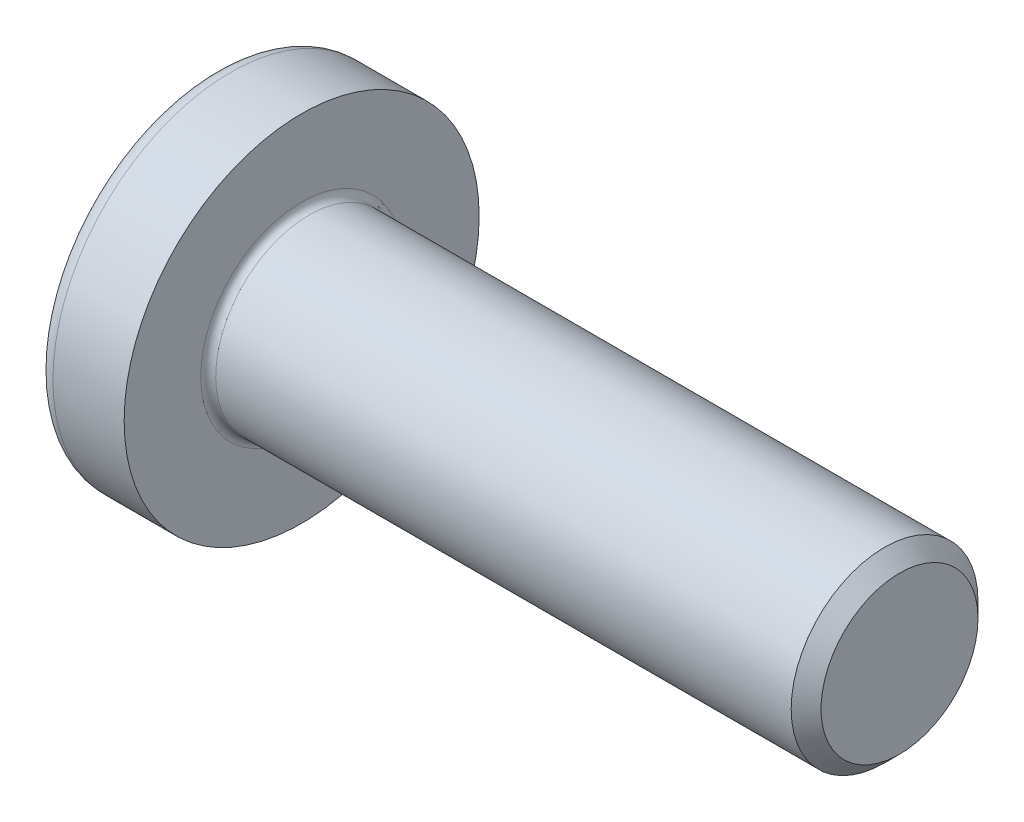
ISO-10303-21;
HEADER;
FILE_DESCRIPTION(('STEP AP214'),'2;1');
FILE_NAME('part.step','',(''),(''),'','','');
FILE_SCHEMA(('AUTOMOTIVE_DESIGN { 1 0 10303 214 1 1 1 1 }'));
ENDSEC;
DATA;
#1=APPLICATION_CONTEXT('core data for automotive mechanical design processes');
#2=APPLICATION_PROTOCOL_DEFINITION('international standard','automotive_design',2000,#1);
#3=PRODUCT_CONTEXT('',#1,'mechanical');
#4=PRODUCT('Part','Part','',(#3));
#5=PRODUCT_RELATED_PRODUCT_CATEGORY('part','',(#4));
#6=PRODUCT_DEFINITION_FORMATION('','',#4);
#7=PRODUCT_DEFINITION_CONTEXT('part definition',#1,'design');
#8=PRODUCT_DEFINITION('design','',#6,#7);
#9=PRODUCT_DEFINITION_SHAPE('','',#8);
#10=(LENGTH_UNIT() NAMED_UNIT(*) SI_UNIT(.MILLI.,.METRE.));
#11=(NAMED_UNIT(*) PLANE_ANGLE_UNIT() SI_UNIT($,.RADIAN.));
#12=(NAMED_UNIT(*) SI_UNIT($,.STERADIAN.) SOLID_ANGLE_UNIT());
#13=UNCERTAINTY_MEASURE_WITH_UNIT(LENGTH_MEASURE(1.E-05),#10,'distance_accuracy_value','');
#14=(GEOMETRIC_REPRESENTATION_CONTEXT(3) GLOBAL_UNCERTAINTY_ASSIGNED_CONTEXT((#13)) GLOBAL_UNIT_ASSIGNED_CONTEXT((#10,
#11,#12)) REPRESENTATION_CONTEXT('',''));
#15=CARTESIAN_POINT('',(0.,0.,0.));
#16=DIRECTION('',(0.,0.,1.));
#17=DIRECTION('',(1.,0.,0.));
#18=AXIS2_PLACEMENT_3D('',#15,#16,#17);
#19=CARTESIAN_POINT('',(8.,0.,0.));
#20=DIRECTION('',(-1.,0.,0.));
#21=DIRECTION('',(0.,1.,0.));
#22=AXIS2_PLACEMENT_3D('',#19,#20,#21);
#23=SPHERICAL_SURFACE('',#22,8.);
#24=CARTESIAN_POINT('',(1.42427123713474,0.,0.));
#25=DIRECTION('',(-1.,0.,0.));
#26=DIRECTION('',(0.,0.,1.));
#27=AXIS2_PLACEMENT_3D('',#24,#25,#26);
#28=CIRCLE('',#27,4.55629139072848);
#29=CARTESIAN_POINT('',(1.42427123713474,0.,4.55629139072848));
#30=VERTEX_POINT('',#29);
#31=EDGE_CURVE('E371',#30,#30,#28,.T.);
#32=ORIENTED_EDGE('',*,*,#31,.T.);
#33=EDGE_LOOP('',(#32));
#34=FACE_BOUND('',#33,.T.);
#35=CARTESIAN_POINT('',(0.0676093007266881,0.,0.));
#36=DIRECTION('',(1.,0.,0.));
#37=DIRECTION('',(0.,0.,-1.));
#38=AXIS2_PLACEMENT_3D('',#35,#36,#37);
#39=CIRCLE('',#38,1.03787176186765);
#40=CARTESIAN_POINT('',(0.067609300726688,-0.514999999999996,-0.901084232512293));
#41=VERTEX_POINT('',#40);
#42=CARTESIAN_POINT('',(0.0676093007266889,-0.901084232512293,-0.515));
#43=VERTEX_POINT('',#42);
#44=EDGE_CURVE('E414',#41,#43,#39,.F.);
#45=ORIENTED_EDGE('',*,*,#44,.F.);
#46=CARTESIAN_POINT('',(8.,-0.515,0.));
#47=DIRECTION('',(0.,1.,0.));
#48=DIRECTION('',(0.,0.,1.));
#49=AXIS2_PLACEMENT_3D('',#46,#47,#48);
#50=CIRCLE('',#49,7.98340622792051);
#51=CARTESIAN_POINT('',(0.322606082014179,-0.514999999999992,-2.18915454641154));
#52=VERTEX_POINT('',#51);
#53=EDGE_CURVE('E363',#52,#41,#50,.T.);
#54=ORIENTED_EDGE('',*,*,#53,.F.);
#55=CARTESIAN_POINT('',(7.34565688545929,0.,1.31240929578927));
#56=DIRECTION('',(0.446197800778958,0.,-0.89493436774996));
#57=DIRECTION('',(-0.89493436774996,0.,-0.446197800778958));
#58=AXIS2_PLACEMENT_3D('',#55,#56,#57);
#59=CIRCLE('',#58,7.86444002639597);
#60=CARTESIAN_POINT('',(0.322606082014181,0.515000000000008,-2.18915454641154));
#61=VERTEX_POINT('',#60);
#62=EDGE_CURVE('E237',#52,#61,#59,.T.);
#63=ORIENTED_EDGE('',*,*,#62,.T.);
#64=CARTESIAN_POINT('',(8.,0.515,0.));
#65=DIRECTION('',(0.,-1.,0.));
#66=DIRECTION('',(0.,0.,-1.));
#67=AXIS2_PLACEMENT_3D('',#64,#65,#66);
#68=CIRCLE('',#67,7.98340622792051);
#69=CARTESIAN_POINT('',(0.0676093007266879,0.515000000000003,-0.901084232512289));
#70=VERTEX_POINT('',#69);
#71=EDGE_CURVE('E367',#70,#61,#68,.T.);
#72=ORIENTED_EDGE('',*,*,#71,.F.);
#73=CARTESIAN_POINT('',(0.0676093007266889,0.901084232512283,-0.515));
#74=VERTEX_POINT('',#73);
#75=EDGE_CURVE('E438',#74,#70,#39,.F.);
#76=ORIENTED_EDGE('',*,*,#75,.F.);
#77=CARTESIAN_POINT('',(8.,0.,-0.515));
#78=DIRECTION('',(0.,0.,1.));
#79=DIRECTION('',(1.,0.,0.));
#80=AXIS2_PLACEMENT_3D('',#77,#78,#79);
#81=CIRCLE('',#80,7.98340622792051);
#82=CARTESIAN_POINT('',(0.32260608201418,2.18915454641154,-0.515));
#83=VERTEX_POINT('',#82);
#84=EDGE_CURVE('E231',#83,#74,#81,.T.);
#85=ORIENTED_EDGE('',*,*,#84,.F.);
#86=CARTESIAN_POINT('',(7.34565688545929,-1.31240929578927,0.));
#87=DIRECTION('',(0.446197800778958,0.89493436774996,0.));
#88=DIRECTION('',(-0.89493436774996,0.446197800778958,0.));
#89=AXIS2_PLACEMENT_3D('',#86,#87,#88);
#90=CIRCLE('',#89,7.86444002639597);
#91=CARTESIAN_POINT('',(0.322606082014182,2.18915454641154,0.514999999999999));
#92=VERTEX_POINT('',#91);
#93=EDGE_CURVE('E234',#83,#92,#90,.T.);
#94=ORIENTED_EDGE('',*,*,#93,.T.);
#95=CARTESIAN_POINT('',(8.,0.,0.515));
#96=DIRECTION('',(0.,0.,-1.));
#97=DIRECTION('',(0.,1.,0.));
#98=AXIS2_PLACEMENT_3D('',#95,#96,#97);
#99=CIRCLE('',#98,7.98340622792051);
#100=CARTESIAN_POINT('',(0.0676093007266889,0.901084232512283,0.515));
#101=VERTEX_POINT('',#100);
#102=EDGE_CURVE('E227',#101,#92,#99,.T.);
#103=ORIENTED_EDGE('',*,*,#102,.F.);
#104=CARTESIAN_POINT('',(0.067609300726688,0.514999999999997,0.901084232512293));
#105=VERTEX_POINT('',#104);
#106=EDGE_CURVE('E435',#105,#101,#39,.F.);
#107=ORIENTED_EDGE('',*,*,#106,.F.);
#108=CARTESIAN_POINT('',(0.322606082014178,0.514999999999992,2.18915454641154));
#109=VERTEX_POINT('',#108);
#110=EDGE_CURVE('E364',#109,#105,#68,.T.);
#111=ORIENTED_EDGE('',*,*,#110,.F.);
#112=CARTESIAN_POINT('',(7.34565688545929,0.,-1.31240929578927));
#113=DIRECTION('',(0.446197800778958,0.,0.89493436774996));
#114=DIRECTION('',(0.89493436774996,0.,-0.446197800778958));
#115=AXIS2_PLACEMENT_3D('',#112,#113,#114);
#116=CIRCLE('',#115,7.86444002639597);
#117=CARTESIAN_POINT('',(0.32260608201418,-0.515000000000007,2.18915454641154));
#118=VERTEX_POINT('',#117);
#119=EDGE_CURVE('E240',#109,#118,#116,.T.);
#120=ORIENTED_EDGE('',*,*,#119,.T.);
#121=CARTESIAN_POINT('',(0.0676093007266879,-0.515000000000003,0.901084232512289));
#122=VERTEX_POINT('',#121);
#123=EDGE_CURVE('E361',#122,#118,#50,.T.);
#124=ORIENTED_EDGE('',*,*,#123,.F.);
#125=CARTESIAN_POINT('',(0.0676093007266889,-0.901084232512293,0.514999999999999));
#126=VERTEX_POINT('',#125);
#127=EDGE_CURVE('E297',#126,#122,#39,.F.);
#128=ORIENTED_EDGE('',*,*,#127,.F.);
#129=CARTESIAN_POINT('',(0.322606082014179,-2.18915454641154,0.514999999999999));
#130=VERTEX_POINT('',#129);
#131=EDGE_CURVE('E228',#130,#126,#99,.T.);
#132=ORIENTED_EDGE('',*,*,#131,.F.);
#133=CARTESIAN_POINT('',(7.34565688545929,1.31240929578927,0.));
#134=DIRECTION('',(0.446197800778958,-0.89493436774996,0.));
#135=DIRECTION('',(0.89493436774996,0.446197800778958,0.));
#136=AXIS2_PLACEMENT_3D('',#133,#134,#135);
#137=CIRCLE('',#136,7.86444002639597);
#138=CARTESIAN_POINT('',(0.322606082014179,-2.18915454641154,-0.515));
#139=VERTEX_POINT('',#138);
#140=EDGE_CURVE('E218',#130,#139,#137,.T.);
#141=ORIENTED_EDGE('',*,*,#140,.T.);
#142=EDGE_CURVE('E57',#43,#139,#81,.T.);
#143=ORIENTED_EDGE('',*,*,#142,.F.);
#144=EDGE_LOOP('',(#45,#54,#63,#72,#76,#85,#94,#103,#107,#111,#120,#124,#128,#132,#141,#143));
#145=FACE_BOUND('',#144,.T.);
#146=ADVANCED_FACE('F34',(#34,#145),#23,.T.);
#147=CARTESIAN_POINT('',(0.,2.35,-0.515));
#148=DIRECTION('',(0.,0.,1.));
#149=DIRECTION('',(1.,0.,0.));
#150=AXIS2_PLACEMENT_3D('',#147,#148,#149);
#151=PLANE('',#150);
#152=ORIENTED_EDGE('',*,*,#84,.T.);
#153=CARTESIAN_POINT('',(-1.51390484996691,1.02651837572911,-0.515));
#154=CARTESIAN_POINT('',(-1.19828075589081,1.00181934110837,-0.515));
#155=CARTESIAN_POINT('',(-0.882669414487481,0.976954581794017,-0.515));
#156=CARTESIAN_POINT('',(-0.251463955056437,0.926774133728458,-0.515));
#157=CARTESIAN_POINT('',(0.0641301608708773,0.901458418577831,-0.515));
#158=CARTESIAN_POINT('',(0.537487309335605,0.863059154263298,-0.515));
#159=CARTESIAN_POINT('',(0.695267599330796,0.850188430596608,-0.515));
#160=CARTESIAN_POINT('',(1.01081295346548,0.824283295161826,-0.515));
#161=CARTESIAN_POINT('',(1.16857801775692,0.811248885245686,-0.515));
#162=CARTESIAN_POINT('',(1.48408237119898,0.784992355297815,-0.515));
#163=CARTESIAN_POINT('',(1.64182166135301,0.771770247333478,-0.515));
#164=CARTESIAN_POINT('',(1.95728793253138,0.7451057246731,-0.515));
#165=CARTESIAN_POINT('',(2.11501491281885,0.731663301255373,-0.515));
#166=CARTESIAN_POINT('',(2.48551875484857,0.699781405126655,-0.515));
#167=CARTESIAN_POINT('',(2.69828652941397,0.681236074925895,-0.515));
#168=CARTESIAN_POINT('',(3.12376344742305,0.643549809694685,-0.515));
#169=CARTESIAN_POINT('',(3.33647259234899,0.624408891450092,-0.515));
#170=CARTESIAN_POINT('',(3.76177021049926,0.585350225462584,-0.515));
#171=CARTESIAN_POINT('',(3.97435870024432,0.565432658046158,-0.515));
#172=CARTESIAN_POINT('',(4.39945864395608,0.524537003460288,-0.515));
#173=CARTESIAN_POINT('',(4.61197008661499,0.503558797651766,-0.515));
#174=CARTESIAN_POINT('',(4.93071637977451,0.470931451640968,-0.515));
#175=CARTESIAN_POINT('',(5.03701000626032,0.459857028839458,-0.515));
#176=CARTESIAN_POINT('',(5.24954252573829,0.437229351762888,-0.515));
#177=CARTESIAN_POINT('',(5.35578142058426,0.425676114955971,-0.515));
#178=CARTESIAN_POINT('',(5.56815317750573,0.401967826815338,-0.515));
#179=CARTESIAN_POINT('',(5.6742860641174,0.389812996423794,-0.515));
#180=CARTESIAN_POINT('',(5.88647145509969,0.364705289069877,-0.515));
#181=CARTESIAN_POINT('',(5.99252394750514,0.35175231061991,-0.515));
#182=CARTESIAN_POINT('',(6.20462993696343,0.324739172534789,-0.515));
#183=CARTESIAN_POINT('',(6.31068325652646,0.310677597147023,-0.515));
#184=CARTESIAN_POINT('',(6.46957142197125,0.288366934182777,-0.515));
#185=CARTESIAN_POINT('',(6.52249184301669,0.280728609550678,-0.515));
#186=CARTESIAN_POINT('',(6.62826069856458,0.2649303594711,-0.515));
#187=CARTESIAN_POINT('',(6.68110912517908,0.256770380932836,-0.515));
#188=CARTESIAN_POINT('',(6.78677752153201,0.239755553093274,-0.515));
#189=CARTESIAN_POINT('',(6.83959732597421,0.230899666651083,-0.515));
#190=CARTESIAN_POINT('',(6.94505554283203,0.212240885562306,-0.515));
#191=CARTESIAN_POINT('',(6.99769400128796,0.202438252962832,-0.515));
#192=CARTESIAN_POINT('',(7.10276751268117,0.181407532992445,-0.515));
#193=CARTESIAN_POINT('',(7.1552022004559,0.17017756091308,-0.515));
#194=CARTESIAN_POINT('',(7.23345080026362,0.151498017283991,-0.515));
#195=CARTESIAN_POINT('',(7.25947836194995,0.144962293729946,-0.515));
#196=CARTESIAN_POINT('',(7.31128722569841,0.130937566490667,-0.515));
#197=CARTESIAN_POINT('',(7.33706839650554,0.123448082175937,-0.515));
#198=CARTESIAN_POINT('',(7.36266137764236,0.115313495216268,-0.515));
#199=B_SPLINE_CURVE_WITH_KNOTS('',3,(#153,#154,#155,#156,#157,#158,#159,#160,#161,#162,#163,
#164,#165,#166,#167,#168,#169,#170,#171,#172,#173,#174,#175,#176,#177,#178,#179,#180,#181,#182,
#183,#184,#185,#186,#187,#188,#189,#190,#191,#192,#193,#194,#195,#196,#197,#198),.UNSPECIFIED.,
.F.,.F.,(4,2,2,2,2,2,2,2,2,2,2,2,2,2,2,2,2,2,2,2,2,2,4),(0.,0.949767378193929,1.89959054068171,
2.37450359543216,2.84941128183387,3.32428857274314,3.79918470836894,4.43990748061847,
5.08061221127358,5.72116905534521,6.36179770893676,6.68240380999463,7.0029982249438,
7.32347575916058,7.64399412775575,7.96492866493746,8.12533319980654,8.28575408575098,
8.44641876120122,8.60703909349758,8.76787376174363,8.84836551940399,8.92889800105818),.UNSPECIFIED.);
#200=CARTESIAN_POINT('',(2.74,0.677477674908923,-0.515));
#201=VERTEX_POINT('',#200);
#202=EDGE_CURVE('E275',#74,#201,#199,.T.);
#203=ORIENTED_EDGE('',*,*,#202,.T.);
#204=DIRECTION('',(0.,1.,0.));
#205=VECTOR('',#204,1.);
#206=CARTESIAN_POINT('',(2.74,-0.983886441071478,-0.515));
#207=LINE('',#206,#205);
#208=CARTESIAN_POINT('',(2.74,0.983886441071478,-0.515));
#209=VERTEX_POINT('',#208);
#210=EDGE_CURVE('E392',#201,#209,#207,.T.);
#211=ORIENTED_EDGE('',*,*,#210,.T.);
#212=DIRECTION('',(0.89493436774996,-0.446197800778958,0.));
#213=VECTOR('',#212,1.);
#214=CARTESIAN_POINT('',(0.,2.35,-0.515));
#215=LINE('',#214,#213);
#216=EDGE_CURVE('E368',#83,#209,#215,.T.);
#217=ORIENTED_EDGE('',*,*,#216,.F.);
#218=EDGE_LOOP('',(#152,#203,#211,#217));
#219=FACE_BOUND('',#218,.T.);
#220=ADVANCED_FACE('F166',(#219),#151,.T.);
#221=CARTESIAN_POINT('',(2.74,-0.983886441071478,-0.515));
#222=VERTEX_POINT('',#221);
#223=CARTESIAN_POINT('',(2.74,-0.677477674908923,-0.515));
#224=VERTEX_POINT('',#223);
#225=EDGE_CURVE('E389',#222,#224,#207,.T.);
#226=ORIENTED_EDGE('',*,*,#225,.T.);
#227=CARTESIAN_POINT('',(-1.51390484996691,-1.02651837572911,-0.515));
#228=CARTESIAN_POINT('',(-1.19828075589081,-1.00181934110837,-0.515));
#229=CARTESIAN_POINT('',(-0.882669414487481,-0.976954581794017,-0.515));
#230=CARTESIAN_POINT('',(-0.251463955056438,-0.926774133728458,-0.515));
#231=CARTESIAN_POINT('',(0.0641301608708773,-0.901458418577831,-0.515));
#232=CARTESIAN_POINT('',(0.537487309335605,-0.863059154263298,-0.515));
#233=CARTESIAN_POINT('',(0.695267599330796,-0.850188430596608,-0.515));
#234=CARTESIAN_POINT('',(1.01081295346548,-0.824283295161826,-0.515));
#235=CARTESIAN_POINT('',(1.16857801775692,-0.811248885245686,-0.515));
#236=CARTESIAN_POINT('',(1.48408237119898,-0.784992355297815,-0.515));
#237=CARTESIAN_POINT('',(1.64182166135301,-0.771770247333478,-0.515));
#238=CARTESIAN_POINT('',(1.95728793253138,-0.7451057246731,-0.515));
#239=CARTESIAN_POINT('',(2.11501491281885,-0.731663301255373,-0.515));
#240=CARTESIAN_POINT('',(2.48551875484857,-0.699781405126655,-0.515));
#241=CARTESIAN_POINT('',(2.69828652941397,-0.681236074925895,-0.515));
#242=CARTESIAN_POINT('',(3.12376344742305,-0.643549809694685,-0.515));
#243=CARTESIAN_POINT('',(3.33647259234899,-0.624408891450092,-0.515));
#244=CARTESIAN_POINT('',(3.76177021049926,-0.585350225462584,-0.515));
#245=CARTESIAN_POINT('',(3.97435870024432,-0.565432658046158,-0.515));
#246=CARTESIAN_POINT('',(4.39945864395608,-0.524537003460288,-0.515));
#247=CARTESIAN_POINT('',(4.61197008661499,-0.503558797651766,-0.515));
#248=CARTESIAN_POINT('',(4.93071637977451,-0.470931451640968,-0.515));
#249=CARTESIAN_POINT('',(5.03701000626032,-0.459857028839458,-0.515));
#250=CARTESIAN_POINT('',(5.24954252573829,-0.437229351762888,-0.515));
#251=CARTESIAN_POINT('',(5.35578142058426,-0.425676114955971,-0.515));
#252=CARTESIAN_POINT('',(5.56815317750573,-0.401967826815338,-0.515));
#253=CARTESIAN_POINT('',(5.6742860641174,-0.389812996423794,-0.515));
#254=CARTESIAN_POINT('',(5.88647145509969,-0.364705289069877,-0.515));
#255=CARTESIAN_POINT('',(5.99252394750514,-0.35175231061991,-0.515));
#256=CARTESIAN_POINT('',(6.20462993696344,-0.324739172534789,-0.515));
#257=CARTESIAN_POINT('',(6.31068325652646,-0.310677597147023,-0.515));
#258=CARTESIAN_POINT('',(6.46957142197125,-0.288366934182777,-0.515));
#259=CARTESIAN_POINT('',(6.52249184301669,-0.280728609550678,-0.515));
#260=CARTESIAN_POINT('',(6.62826069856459,-0.2649303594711,-0.515));
#261=CARTESIAN_POINT('',(6.68110912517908,-0.256770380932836,-0.515));
#262=CARTESIAN_POINT('',(6.78677752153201,-0.239755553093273,-0.515));
#263=CARTESIAN_POINT('',(6.83959732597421,-0.230899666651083,-0.515));
#264=CARTESIAN_POINT('',(6.94505554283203,-0.212240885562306,-0.515));
#265=CARTESIAN_POINT('',(6.99769400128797,-0.202438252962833,-0.515));
#266=CARTESIAN_POINT('',(7.10276751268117,-0.181407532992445,-0.515));
#267=CARTESIAN_POINT('',(7.1552022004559,-0.170177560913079,-0.515));
#268=CARTESIAN_POINT('',(7.23345080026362,-0.15149801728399,-0.515));
#269=CARTESIAN_POINT('',(7.25947836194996,-0.144962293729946,-0.515));
#270=CARTESIAN_POINT('',(7.31128722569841,-0.130937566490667,-0.515));
#271=CARTESIAN_POINT('',(7.33706839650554,-0.123448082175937,-0.515));
#272=CARTESIAN_POINT('',(7.36266137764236,-0.115313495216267,-0.515));
#273=B_SPLINE_CURVE_WITH_KNOTS('',3,(#227,#228,#229,#230,#231,#232,#233,#234,#235,#236,#237,
#238,#239,#240,#241,#242,#243,#244,#245,#246,#247,#248,#249,#250,#251,#252,#253,#254,#255,#256,
#257,#258,#259,#260,#261,#262,#263,#264,#265,#266,#267,#268,#269,#270,#271,#272),.UNSPECIFIED.,
.F.,.F.,(4,2,2,2,2,2,2,2,2,2,2,2,2,2,2,2,2,2,2,2,2,2,4),(0.,0.949767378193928,1.89959054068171,
2.37450359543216,2.84941128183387,3.32428857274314,3.79918470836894,4.43990748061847,
5.08061221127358,5.72116905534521,6.36179770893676,6.68240380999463,7.0029982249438,
7.32347575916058,7.64399412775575,7.96492866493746,8.12533319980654,8.28575408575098,
8.44641876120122,8.60703909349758,8.76787376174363,8.84836551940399,8.92889800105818),.UNSPECIFIED.);
#274=EDGE_CURVE('E262',#224,#43,#273,.F.);
#275=ORIENTED_EDGE('',*,*,#274,.T.);
#276=ORIENTED_EDGE('',*,*,#142,.T.);
#277=DIRECTION('',(0.89493436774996,0.446197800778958,0.));
#278=VECTOR('',#277,1.);
#279=CARTESIAN_POINT('',(0.,-2.35,-0.515));
#280=LINE('',#279,#278);
#281=EDGE_CURVE('E374',#139,#222,#280,.T.);
#282=ORIENTED_EDGE('',*,*,#281,.T.);
#283=EDGE_LOOP('',(#226,#275,#276,#282));
#284=FACE_BOUND('',#283,.T.);
#285=ADVANCED_FACE('F172',(#284),#151,.T.);
#286=CARTESIAN_POINT('',(0.,-2.35,0.514999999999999));
#287=DIRECTION('',(0.,0.,-1.));
#288=DIRECTION('',(0.,1.,0.));
#289=AXIS2_PLACEMENT_3D('',#286,#287,#288);
#290=PLANE('',#289);
#291=DIRECTION('',(0.,-1.,0.));
#292=VECTOR('',#291,1.);
#293=CARTESIAN_POINT('',(2.74,0.983886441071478,0.515));
#294=LINE('',#293,#292);
#295=CARTESIAN_POINT('',(2.74,0.983886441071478,0.515));
#296=VERTEX_POINT('',#295);
#297=CARTESIAN_POINT('',(2.74,0.677477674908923,0.515));
#298=VERTEX_POINT('',#297);
#299=EDGE_CURVE('E382',#296,#298,#294,.T.);
#300=ORIENTED_EDGE('',*,*,#299,.T.);
#301=CARTESIAN_POINT('',(-1.51390485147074,1.02651837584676,0.514999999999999));
#302=CARTESIAN_POINT('',(-1.19828075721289,1.00181934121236,0.514999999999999));
#303=CARTESIAN_POINT('',(-0.882669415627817,0.976954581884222,0.514999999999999));
#304=CARTESIAN_POINT('',(-0.251463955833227,0.926774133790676,0.515));
#305=CARTESIAN_POINT('',(0.0641301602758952,0.901458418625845,0.515));
#306=CARTESIAN_POINT('',(0.537487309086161,0.863059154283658,0.515));
#307=CARTESIAN_POINT('',(0.695267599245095,0.85018843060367,0.515));
#308=CARTESIAN_POINT('',(1.01081295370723,0.824283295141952,0.515));
#309=CARTESIAN_POINT('',(1.16857801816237,0.811248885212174,0.515));
#310=CARTESIAN_POINT('',(1.48408237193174,0.784992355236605,0.515));
#311=CARTESIAN_POINT('',(1.64182166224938,0.771770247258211,0.515));
#312=CARTESIAN_POINT('',(1.95728793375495,0.745105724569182,0.515));
#313=CARTESIAN_POINT('',(2.11501491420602,0.731663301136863,0.515));
#314=CARTESIAN_POINT('',(2.48551875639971,0.699781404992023,0.515));
#315=CARTESIAN_POINT('',(2.6982865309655,0.681236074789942,0.515));
#316=CARTESIAN_POINT('',(3.12376344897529,0.643549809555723,0.515));
#317=CARTESIAN_POINT('',(3.33647259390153,0.624408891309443,0.515));
#318=CARTESIAN_POINT('',(3.76177021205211,0.585350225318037,0.515));
#319=CARTESIAN_POINT('',(3.97435870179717,0.565432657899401,0.515));
#320=CARTESIAN_POINT('',(4.39945864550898,0.524537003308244,0.515));
#321=CARTESIAN_POINT('',(4.61197008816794,0.503558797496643,0.515));
#322=CARTESIAN_POINT('',(4.9307163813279,0.470931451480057,0.515));
#323=CARTESIAN_POINT('',(5.03701000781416,0.459857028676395,0.515));
#324=CARTESIAN_POINT('',(5.24954252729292,0.437229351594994,0.515));
#325=CARTESIAN_POINT('',(5.35578142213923,0.4256761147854,0.515));
#326=CARTESIAN_POINT('',(5.56815317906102,0.401967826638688,0.515));
#327=CARTESIAN_POINT('',(5.67428606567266,0.389812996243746,0.515));
#328=CARTESIAN_POINT('',(5.88647145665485,0.36470528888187,0.515));
#329=CARTESIAN_POINT('',(5.99252394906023,0.351752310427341,0.515));
#330=CARTESIAN_POINT('',(6.204629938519,0.324739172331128,0.515));
#331=CARTESIAN_POINT('',(6.31068325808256,0.31067759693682,0.515));
#332=CARTESIAN_POINT('',(6.46957142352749,0.288366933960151,0.515));
#333=CARTESIAN_POINT('',(6.52249184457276,0.280728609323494,0.515));
#334=CARTESIAN_POINT('',(6.62826070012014,0.26493035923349,0.515));
#335=CARTESIAN_POINT('',(6.68110912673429,0.256770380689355,0.515));
#336=CARTESIAN_POINT('',(6.7867775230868,0.239755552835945,0.515));
#337=CARTESIAN_POINT('',(6.83959732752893,0.230899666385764,0.515));
#338=CARTESIAN_POINT('',(6.94505554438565,0.212240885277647,0.515));
#339=CARTESIAN_POINT('',(6.99769400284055,0.202438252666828,0.515));
#340=CARTESIAN_POINT('',(7.10276751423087,0.181407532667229,0.515));
#341=CARTESIAN_POINT('',(7.15520220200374,0.170177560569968,0.515));
#342=CARTESIAN_POINT('',(7.23345080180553,0.151498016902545,0.515));
#343=CARTESIAN_POINT('',(7.25947836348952,0.144962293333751,0.515));
#344=CARTESIAN_POINT('',(7.31128722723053,0.130937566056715,0.515));
#345=CARTESIAN_POINT('',(7.33706839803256,0.123448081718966,0.515));
#346=CARTESIAN_POINT('',(7.36266137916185,0.115313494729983,0.515));
#347=B_SPLINE_CURVE_WITH_KNOTS('',3,(#301,#302,#303,#304,#305,#306,#307,#308,#309,#310,#311,
#312,#313,#314,#315,#316,#317,#318,#319,#320,#321,#322,#323,#324,#325,#326,#327,#328,#329,#330,
#331,#332,#333,#334,#335,#336,#337,#338,#339,#340,#341,#342,#343,#344,#345,#346),.UNSPECIFIED.,
.F.,.F.,(4,2,2,2,2,2,2,2,2,2,2,2,2,2,2,2,2,2,2,2,2,2,4),(0.,0.949767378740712,1.89959054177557,
2.37450359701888,2.8494112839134,3.32428857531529,3.79918471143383,4.43990748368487,
5.08061221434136,5.7211690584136,6.36179771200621,6.68240381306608,7.00299822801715,
7.32347576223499,7.6439941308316,7.96492866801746,8.12533320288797,8.28575408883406,
8.44641876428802,8.6070390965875,8.76787376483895,8.84836552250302,8.92889800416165),.UNSPECIFIED.);
#348=EDGE_CURVE('E286',#298,#101,#347,.F.);
#349=ORIENTED_EDGE('',*,*,#348,.T.);
#350=ORIENTED_EDGE('',*,*,#102,.T.);
#351=DIRECTION('',(0.89493436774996,-0.446197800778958,0.));
#352=VECTOR('',#351,1.);
#353=CARTESIAN_POINT('',(0.,2.35,0.515));
#354=LINE('',#353,#352);
#355=EDGE_CURVE('E372',#92,#296,#354,.T.);
#356=ORIENTED_EDGE('',*,*,#355,.T.);
#357=EDGE_LOOP('',(#300,#349,#350,#356));
#358=FACE_BOUND('',#357,.T.);
#359=ADVANCED_FACE('F307',(#358),#290,.T.);
#360=ORIENTED_EDGE('',*,*,#131,.T.);
#361=CARTESIAN_POINT('',(-1.51390485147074,-1.02651837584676,0.514999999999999));
#362=CARTESIAN_POINT('',(-1.19828075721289,-1.00181934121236,0.514999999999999));
#363=CARTESIAN_POINT('',(-0.882669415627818,-0.976954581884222,0.514999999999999));
#364=CARTESIAN_POINT('',(-0.251463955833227,-0.926774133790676,0.514999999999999));
#365=CARTESIAN_POINT('',(0.0641301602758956,-0.901458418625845,0.514999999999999));
#366=CARTESIAN_POINT('',(0.537487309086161,-0.863059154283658,0.514999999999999));
#367=CARTESIAN_POINT('',(0.695267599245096,-0.850188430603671,0.514999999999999));
#368=CARTESIAN_POINT('',(1.01081295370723,-0.824283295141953,0.514999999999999));
#369=CARTESIAN_POINT('',(1.16857801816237,-0.811248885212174,0.514999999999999));
#370=CARTESIAN_POINT('',(1.48408237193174,-0.784992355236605,0.514999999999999));
#371=CARTESIAN_POINT('',(1.64182166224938,-0.771770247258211,0.514999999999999));
#372=CARTESIAN_POINT('',(1.95728793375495,-0.745105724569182,0.514999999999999));
#373=CARTESIAN_POINT('',(2.11501491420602,-0.731663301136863,0.515));
#374=CARTESIAN_POINT('',(2.48551875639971,-0.699781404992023,0.515));
#375=CARTESIAN_POINT('',(2.6982865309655,-0.681236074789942,0.515));
#376=CARTESIAN_POINT('',(3.12376344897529,-0.643549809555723,0.515));
#377=CARTESIAN_POINT('',(3.33647259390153,-0.624408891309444,0.515));
#378=CARTESIAN_POINT('',(3.76177021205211,-0.585350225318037,0.515));
#379=CARTESIAN_POINT('',(3.97435870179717,-0.565432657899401,0.515));
#380=CARTESIAN_POINT('',(4.39945864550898,-0.524537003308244,0.515));
#381=CARTESIAN_POINT('',(4.61197008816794,-0.503558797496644,0.515));
#382=CARTESIAN_POINT('',(4.9307163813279,-0.470931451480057,0.515));
#383=CARTESIAN_POINT('',(5.03701000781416,-0.459857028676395,0.515));
#384=CARTESIAN_POINT('',(5.24954252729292,-0.437229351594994,0.515));
#385=CARTESIAN_POINT('',(5.35578142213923,-0.4256761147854,0.515));
#386=CARTESIAN_POINT('',(5.56815317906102,-0.401967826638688,0.515));
#387=CARTESIAN_POINT('',(5.67428606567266,-0.389812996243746,0.515));
#388=CARTESIAN_POINT('',(5.88647145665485,-0.36470528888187,0.515));
#389=CARTESIAN_POINT('',(5.99252394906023,-0.351752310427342,0.515));
#390=CARTESIAN_POINT('',(6.20462993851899,-0.324739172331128,0.515));
#391=CARTESIAN_POINT('',(6.31068325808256,-0.31067759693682,0.515));
#392=CARTESIAN_POINT('',(6.46957142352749,-0.288366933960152,0.515));
#393=CARTESIAN_POINT('',(6.52249184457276,-0.280728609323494,0.515));
#394=CARTESIAN_POINT('',(6.62826070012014,-0.264930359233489,0.515));
#395=CARTESIAN_POINT('',(6.68110912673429,-0.256770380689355,0.515));
#396=CARTESIAN_POINT('',(6.7867775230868,-0.239755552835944,0.515));
#397=CARTESIAN_POINT('',(6.83959732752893,-0.230899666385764,0.515));
#398=CARTESIAN_POINT('',(6.94505554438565,-0.212240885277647,0.515));
#399=CARTESIAN_POINT('',(6.99769400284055,-0.202438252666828,0.515));
#400=CARTESIAN_POINT('',(7.10276751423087,-0.181407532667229,0.515));
#401=CARTESIAN_POINT('',(7.15520220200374,-0.170177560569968,0.515));
#402=CARTESIAN_POINT('',(7.23345080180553,-0.151498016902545,0.515));
#403=CARTESIAN_POINT('',(7.25947836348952,-0.144962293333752,0.515));
#404=CARTESIAN_POINT('',(7.31128722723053,-0.130937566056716,0.515));
#405=CARTESIAN_POINT('',(7.33706839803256,-0.123448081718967,0.515));
#406=CARTESIAN_POINT('',(7.36266137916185,-0.115313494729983,0.515));
#407=B_SPLINE_CURVE_WITH_KNOTS('',3,(#361,#362,#363,#364,#365,#366,#367,#368,#369,#370,#371,
#372,#373,#374,#375,#376,#377,#378,#379,#380,#381,#382,#383,#384,#385,#386,#387,#388,#389,#390,
#391,#392,#393,#394,#395,#396,#397,#398,#399,#400,#401,#402,#403,#404,#405,#406),.UNSPECIFIED.,
.F.,.F.,(4,2,2,2,2,2,2,2,2,2,2,2,2,2,2,2,2,2,2,2,2,2,4),(0.,0.949767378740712,1.89959054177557,
2.37450359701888,2.8494112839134,3.32428857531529,3.79918471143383,4.43990748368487,
5.08061221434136,5.7211690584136,6.36179771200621,6.68240381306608,7.00299822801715,
7.32347576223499,7.6439941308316,7.96492866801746,8.12533320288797,8.28575408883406,
8.44641876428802,8.6070390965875,8.76787376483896,8.84836552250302,8.92889800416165),.UNSPECIFIED.);
#408=CARTESIAN_POINT('',(2.74,-0.677477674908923,0.515));
#409=VERTEX_POINT('',#408);
#410=EDGE_CURVE('E298',#126,#409,#407,.T.);
#411=ORIENTED_EDGE('',*,*,#410,.T.);
#412=CARTESIAN_POINT('',(2.74,-0.983886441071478,0.515));
#413=VERTEX_POINT('',#412);
#414=EDGE_CURVE('E385',#409,#413,#294,.T.);
#415=ORIENTED_EDGE('',*,*,#414,.T.);
#416=DIRECTION('',(0.89493436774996,0.446197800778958,0.));
#417=VECTOR('',#416,1.);
#418=CARTESIAN_POINT('',(0.,-2.35,0.514999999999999));
#419=LINE('',#418,#417);
#420=EDGE_CURVE('E376',#130,#413,#419,.T.);
#421=ORIENTED_EDGE('',*,*,#420,.F.);
#422=EDGE_LOOP('',(#360,#411,#415,#421));
#423=FACE_BOUND('',#422,.T.);
#424=ADVANCED_FACE('F311',(#423),#290,.T.);
#425=CARTESIAN_POINT('',(2.74,-0.983886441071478,-0.515));
#426=DIRECTION('',(1.,0.,0.));
#427=DIRECTION('',(0.,0.,-1.));
#428=AXIS2_PLACEMENT_3D('',#425,#426,#427);
#429=PLANE('',#428);
#430=CARTESIAN_POINT('',(2.74,0.,0.));
#431=DIRECTION('',(-1.,0.,0.));
#432=DIRECTION('',(0.,0.,1.));
#433=AXIS2_PLACEMENT_3D('',#430,#431,#432);
#434=CIRCLE('',#433,0.851);
#435=EDGE_CURVE('E448',#224,#409,#434,.T.);
#436=ORIENTED_EDGE('',*,*,#435,.F.);
#437=ORIENTED_EDGE('',*,*,#225,.F.);
#438=DIRECTION('',(0.,0.,1.));
#439=VECTOR('',#438,1.);
#440=CARTESIAN_POINT('',(2.74,-0.983886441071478,-0.515));
#441=LINE('',#440,#439);
#442=EDGE_CURVE('E379',#222,#413,#441,.T.);
#443=ORIENTED_EDGE('',*,*,#442,.T.);
#444=ORIENTED_EDGE('',*,*,#414,.F.);
#445=EDGE_LOOP('',(#436,#437,#443,#444));
#446=FACE_BOUND('',#445,.T.);
#447=ADVANCED_FACE('F317',(#446),#429,.F.);
#448=CARTESIAN_POINT('',(2.74,-0.515000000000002,0.677477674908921));
#449=VERTEX_POINT('',#448);
#450=CARTESIAN_POINT('',(2.74,0.514999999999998,0.677477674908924));
#451=VERTEX_POINT('',#450);
#452=EDGE_CURVE('E426',#449,#451,#434,.T.);
#453=ORIENTED_EDGE('',*,*,#452,.F.);
#454=DIRECTION('',(0.,0.,-1.));
#455=VECTOR('',#454,1.);
#456=CARTESIAN_POINT('',(2.74,-0.515000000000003,0.983886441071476));
#457=LINE('',#456,#455);
#458=CARTESIAN_POINT('',(2.74,-0.515000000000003,0.983886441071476));
#459=VERTEX_POINT('',#458);
#460=EDGE_CURVE('E417',#459,#449,#457,.T.);
#461=ORIENTED_EDGE('',*,*,#460,.F.);
#462=DIRECTION('',(0.,1.,0.));
#463=VECTOR('',#462,1.);
#464=CARTESIAN_POINT('',(2.74,-0.515000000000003,0.983886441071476));
#465=LINE('',#464,#463);
#466=CARTESIAN_POINT('',(2.74,0.514999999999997,0.98388644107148));
#467=VERTEX_POINT('',#466);
#468=EDGE_CURVE('E355',#459,#467,#465,.T.);
#469=ORIENTED_EDGE('',*,*,#468,.T.);
#470=DIRECTION('',(0.,0.,1.));
#471=VECTOR('',#470,1.);
#472=CARTESIAN_POINT('',(2.74,0.515000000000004,-0.983886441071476));
#473=LINE('',#472,#471);
#474=EDGE_CURVE('E304',#451,#467,#473,.T.);
#475=ORIENTED_EDGE('',*,*,#474,.F.);
#476=EDGE_LOOP('',(#453,#461,#469,#475));
#477=FACE_BOUND('',#476,.T.);
#478=ADVANCED_FACE('F319',(#477),#429,.F.);
#479=EDGE_CURVE('E442',#298,#201,#434,.T.);
#480=ORIENTED_EDGE('',*,*,#479,.F.);
#481=ORIENTED_EDGE('',*,*,#299,.F.);
#482=DIRECTION('',(0.,0.,-1.));
#483=VECTOR('',#482,1.);
#484=CARTESIAN_POINT('',(2.74,0.983886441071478,0.515));
#485=LINE('',#484,#483);
#486=EDGE_CURVE('E386',#296,#209,#485,.T.);
#487=ORIENTED_EDGE('',*,*,#486,.T.);
#488=ORIENTED_EDGE('',*,*,#210,.F.);
#489=EDGE_LOOP('',(#480,#481,#487,#488));
#490=FACE_BOUND('',#489,.T.);
#491=ADVANCED_FACE('F326',(#490),#429,.F.);
#492=CARTESIAN_POINT('',(2.74,0.515000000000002,-0.677477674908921));
#493=VERTEX_POINT('',#492);
#494=CARTESIAN_POINT('',(2.74,-0.514999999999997,-0.677477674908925));
#495=VERTEX_POINT('',#494);
#496=EDGE_CURVE('E49',#493,#495,#434,.T.);
#497=ORIENTED_EDGE('',*,*,#496,.F.);
#498=CARTESIAN_POINT('',(2.74,0.515000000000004,-0.983886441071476));
#499=VERTEX_POINT('',#498);
#500=EDGE_CURVE('E343',#499,#493,#473,.T.);
#501=ORIENTED_EDGE('',*,*,#500,.F.);
#502=DIRECTION('',(0.,-1.,0.));
#503=VECTOR('',#502,1.);
#504=CARTESIAN_POINT('',(2.74,0.515000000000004,-0.983886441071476));
#505=LINE('',#504,#503);
#506=CARTESIAN_POINT('',(2.74,-0.514999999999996,-0.983886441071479));
#507=VERTEX_POINT('',#506);
#508=EDGE_CURVE('E407',#499,#507,#505,.T.);
#509=ORIENTED_EDGE('',*,*,#508,.T.);
#510=EDGE_CURVE('E344',#495,#507,#457,.T.);
#511=ORIENTED_EDGE('',*,*,#510,.F.);
#512=EDGE_LOOP('',(#497,#501,#509,#511));
#513=FACE_BOUND('',#512,.T.);
#514=ADVANCED_FACE('F321',(#513),#429,.F.);
#515=CARTESIAN_POINT('',(0.,-0.514999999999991,-2.35));
#516=DIRECTION('',(0.,1.,0.));
#517=DIRECTION('',(0.,0.,1.));
#518=AXIS2_PLACEMENT_3D('',#515,#516,#517);
#519=PLANE('',#518);
#520=ORIENTED_EDGE('',*,*,#460,.T.);
#521=CARTESIAN_POINT('',(-1.51390485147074,-0.515000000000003,1.02651837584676));
#522=CARTESIAN_POINT('',(-1.19828075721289,-0.515000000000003,1.00181934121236));
#523=CARTESIAN_POINT('',(-0.882669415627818,-0.515000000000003,0.97695458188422));
#524=CARTESIAN_POINT('',(-0.251463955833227,-0.515000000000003,0.926774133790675));
#525=CARTESIAN_POINT('',(0.0641301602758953,-0.515000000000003,0.901458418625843));
#526=CARTESIAN_POINT('',(0.537487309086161,-0.515000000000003,0.863059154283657));
#527=CARTESIAN_POINT('',(0.695267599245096,-0.515000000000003,0.850188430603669));
#528=CARTESIAN_POINT('',(1.01081295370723,-0.515000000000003,0.824283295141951));
#529=CARTESIAN_POINT('',(1.16857801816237,-0.515000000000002,0.811248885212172));
#530=CARTESIAN_POINT('',(1.48408237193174,-0.515000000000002,0.784992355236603));
#531=CARTESIAN_POINT('',(1.64182166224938,-0.515000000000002,0.771770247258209));
#532=CARTESIAN_POINT('',(1.95728793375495,-0.515000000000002,0.74510572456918));
#533=CARTESIAN_POINT('',(2.11501491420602,-0.515000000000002,0.731663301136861));
#534=CARTESIAN_POINT('',(2.48551875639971,-0.515000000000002,0.699781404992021));
#535=CARTESIAN_POINT('',(2.6982865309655,-0.515000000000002,0.68123607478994));
#536=CARTESIAN_POINT('',(3.12376344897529,-0.515000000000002,0.643549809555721));
#537=CARTESIAN_POINT('',(3.33647259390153,-0.515000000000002,0.624408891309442));
#538=CARTESIAN_POINT('',(3.76177021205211,-0.515000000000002,0.585350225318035));
#539=CARTESIAN_POINT('',(3.97435870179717,-0.515000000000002,0.565432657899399));
#540=CARTESIAN_POINT('',(4.39945864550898,-0.515000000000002,0.524537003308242));
#541=CARTESIAN_POINT('',(4.61197008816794,-0.515000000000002,0.503558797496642));
#542=CARTESIAN_POINT('',(4.93071638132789,-0.515000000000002,0.470931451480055));
#543=CARTESIAN_POINT('',(5.03701000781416,-0.515000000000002,0.459857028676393));
#544=CARTESIAN_POINT('',(5.24954252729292,-0.515000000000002,0.437229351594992));
#545=CARTESIAN_POINT('',(5.35578142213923,-0.515000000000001,0.425676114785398));
#546=CARTESIAN_POINT('',(5.56815317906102,-0.515000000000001,0.401967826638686));
#547=CARTESIAN_POINT('',(5.67428606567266,-0.515000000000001,0.389812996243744));
#548=CARTESIAN_POINT('',(5.88647145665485,-0.515000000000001,0.364705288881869));
#549=CARTESIAN_POINT('',(5.99252394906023,-0.515000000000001,0.35175231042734));
#550=CARTESIAN_POINT('',(6.20462993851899,-0.515000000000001,0.324739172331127));
#551=CARTESIAN_POINT('',(6.31068325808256,-0.515000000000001,0.310677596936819));
#552=CARTESIAN_POINT('',(6.46957142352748,-0.515000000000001,0.28836693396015));
#553=CARTESIAN_POINT('',(6.52249184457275,-0.515000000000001,0.280728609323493));
#554=CARTESIAN_POINT('',(6.62826070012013,-0.515000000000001,0.264930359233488));
#555=CARTESIAN_POINT('',(6.68110912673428,-0.515000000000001,0.256770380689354));
#556=CARTESIAN_POINT('',(6.7867775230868,-0.515000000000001,0.239755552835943));
#557=CARTESIAN_POINT('',(6.83959732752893,-0.515000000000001,0.230899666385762));
#558=CARTESIAN_POINT('',(6.94505554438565,-0.515000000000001,0.212240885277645));
#559=CARTESIAN_POINT('',(6.99769400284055,-0.515000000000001,0.202438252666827));
#560=CARTESIAN_POINT('',(7.10276751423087,-0.515000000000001,0.181407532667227));
#561=CARTESIAN_POINT('',(7.15520220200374,-0.515000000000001,0.170177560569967));
#562=CARTESIAN_POINT('',(7.23345080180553,-0.515000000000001,0.151498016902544));
#563=CARTESIAN_POINT('',(7.25947836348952,-0.515000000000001,0.14496229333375));
#564=CARTESIAN_POINT('',(7.31128722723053,-0.515000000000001,0.130937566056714));
#565=CARTESIAN_POINT('',(7.33706839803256,-0.515000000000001,0.123448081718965));
#566=CARTESIAN_POINT('',(7.36266137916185,-0.515000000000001,0.115313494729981));
#567=B_SPLINE_CURVE_WITH_KNOTS('',3,(#521,#522,#523,#524,#525,#526,#527,#528,#529,#530,#531,
#532,#533,#534,#535,#536,#537,#538,#539,#540,#541,#542,#543,#544,#545,#546,#547,#548,#549,#550,
#551,#552,#553,#554,#555,#556,#557,#558,#559,#560,#561,#562,#563,#564,#565,#566),.UNSPECIFIED.,
.F.,.F.,(4,2,2,2,2,2,2,2,2,2,2,2,2,2,2,2,2,2,2,2,2,2,4),(0.,0.949767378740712,1.89959054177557,
2.37450359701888,2.8494112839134,3.32428857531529,3.79918471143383,4.43990748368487,
5.08061221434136,5.72116905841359,6.36179771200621,6.68240381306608,7.00299822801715,
7.32347576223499,7.6439941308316,7.96492866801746,8.12533320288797,8.28575408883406,
8.44641876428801,8.6070390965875,8.76787376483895,8.84836552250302,8.92889800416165),.UNSPECIFIED.);
#568=EDGE_CURVE('E292',#449,#122,#567,.F.);
#569=ORIENTED_EDGE('',*,*,#568,.T.);
#570=ORIENTED_EDGE('',*,*,#123,.T.);
#571=DIRECTION('',(0.89493436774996,0.,-0.446197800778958));
#572=VECTOR('',#571,1.);
#573=CARTESIAN_POINT('',(0.,-0.515000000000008,2.35));
#574=LINE('',#573,#572);
#575=EDGE_CURVE('E408',#118,#459,#574,.T.);
#576=ORIENTED_EDGE('',*,*,#575,.T.);
#577=EDGE_LOOP('',(#520,#569,#570,#576));
#578=FACE_BOUND('',#577,.T.);
#579=ADVANCED_FACE('F249',(#578),#519,.T.);
#580=CARTESIAN_POINT('',(0.,0.514999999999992,2.35));
#581=DIRECTION('',(0.,-1.,0.));
#582=DIRECTION('',(1.,0.,0.));
#583=AXIS2_PLACEMENT_3D('',#580,#581,#582);
#584=PLANE('',#583);
#585=ORIENTED_EDGE('',*,*,#110,.T.);
#586=CARTESIAN_POINT('',(-1.51390484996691,0.514999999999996,1.02651837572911));
#587=CARTESIAN_POINT('',(-1.19828075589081,0.514999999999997,1.00181934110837));
#588=CARTESIAN_POINT('',(-0.882669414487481,0.514999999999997,0.976954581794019));
#589=CARTESIAN_POINT('',(-0.251463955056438,0.514999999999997,0.92677413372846));
#590=CARTESIAN_POINT('',(0.0641301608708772,0.514999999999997,0.901458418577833));
#591=CARTESIAN_POINT('',(0.537487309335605,0.514999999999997,0.8630591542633));
#592=CARTESIAN_POINT('',(0.695267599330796,0.514999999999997,0.850188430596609));
#593=CARTESIAN_POINT('',(1.01081295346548,0.514999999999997,0.824283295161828));
#594=CARTESIAN_POINT('',(1.16857801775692,0.514999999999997,0.811248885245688));
#595=CARTESIAN_POINT('',(1.48408237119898,0.514999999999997,0.784992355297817));
#596=CARTESIAN_POINT('',(1.64182166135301,0.514999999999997,0.77177024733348));
#597=CARTESIAN_POINT('',(1.95728793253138,0.514999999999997,0.745105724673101));
#598=CARTESIAN_POINT('',(2.11501491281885,0.514999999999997,0.731663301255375));
#599=CARTESIAN_POINT('',(2.48551875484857,0.514999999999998,0.699781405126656));
#600=CARTESIAN_POINT('',(2.69828652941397,0.514999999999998,0.681236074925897));
#601=CARTESIAN_POINT('',(3.12376344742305,0.514999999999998,0.643549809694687));
#602=CARTESIAN_POINT('',(3.33647259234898,0.514999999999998,0.624408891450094));
#603=CARTESIAN_POINT('',(3.76177021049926,0.514999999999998,0.585350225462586));
#604=CARTESIAN_POINT('',(3.97435870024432,0.514999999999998,0.56543265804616));
#605=CARTESIAN_POINT('',(4.39945864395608,0.514999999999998,0.524537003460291));
#606=CARTESIAN_POINT('',(4.61197008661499,0.514999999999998,0.503558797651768));
#607=CARTESIAN_POINT('',(4.93071637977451,0.514999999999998,0.47093145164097));
#608=CARTESIAN_POINT('',(5.03701000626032,0.514999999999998,0.459857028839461));
#609=CARTESIAN_POINT('',(5.24954252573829,0.514999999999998,0.43722935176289));
#610=CARTESIAN_POINT('',(5.35578142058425,0.514999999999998,0.425676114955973));
#611=CARTESIAN_POINT('',(5.56815317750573,0.514999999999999,0.40196782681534));
#612=CARTESIAN_POINT('',(5.6742860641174,0.514999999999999,0.389812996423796));
#613=CARTESIAN_POINT('',(5.88647145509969,0.514999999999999,0.364705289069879));
#614=CARTESIAN_POINT('',(5.99252394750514,0.514999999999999,0.351752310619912));
#615=CARTESIAN_POINT('',(6.20462993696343,0.514999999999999,0.324739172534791));
#616=CARTESIAN_POINT('',(6.31068325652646,0.514999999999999,0.310677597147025));
#617=CARTESIAN_POINT('',(6.46957142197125,0.514999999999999,0.288366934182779));
#618=CARTESIAN_POINT('',(6.52249184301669,0.514999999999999,0.28072860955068));
#619=CARTESIAN_POINT('',(6.62826069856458,0.514999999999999,0.264930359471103));
#620=CARTESIAN_POINT('',(6.68110912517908,0.514999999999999,0.256770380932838));
#621=CARTESIAN_POINT('',(6.78677752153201,0.514999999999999,0.239755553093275));
#622=CARTESIAN_POINT('',(6.83959732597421,0.514999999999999,0.230899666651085));
#623=CARTESIAN_POINT('',(6.94505554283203,0.514999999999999,0.212240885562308));
#624=CARTESIAN_POINT('',(6.99769400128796,0.514999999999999,0.202438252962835));
#625=CARTESIAN_POINT('',(7.10276751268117,0.514999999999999,0.181407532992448));
#626=CARTESIAN_POINT('',(7.1552022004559,0.514999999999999,0.170177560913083));
#627=CARTESIAN_POINT('',(7.23345080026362,0.514999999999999,0.151498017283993));
#628=CARTESIAN_POINT('',(7.25947836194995,0.514999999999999,0.144962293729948));
#629=CARTESIAN_POINT('',(7.31128722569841,0.514999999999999,0.130937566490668));
#630=CARTESIAN_POINT('',(7.33706839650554,0.514999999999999,0.123448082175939));
#631=CARTESIAN_POINT('',(7.36266137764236,0.515,0.115313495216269));
#632=B_SPLINE_CURVE_WITH_KNOTS('',3,(#586,#587,#588,#589,#590,#591,#592,#593,#594,#595,#596,
#597,#598,#599,#600,#601,#602,#603,#604,#605,#606,#607,#608,#609,#610,#611,#612,#613,#614,#615,
#616,#617,#618,#619,#620,#621,#622,#623,#624,#625,#626,#627,#628,#629,#630,#631),.UNSPECIFIED.,
.F.,.F.,(4,2,2,2,2,2,2,2,2,2,2,2,2,2,2,2,2,2,2,2,2,2,4),(0.,0.949767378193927,1.89959054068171,
2.37450359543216,2.84941128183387,3.32428857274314,3.79918470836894,4.43990748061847,
5.08061221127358,5.72116905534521,6.36179770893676,6.68240380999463,7.0029982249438,
7.32347575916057,7.64399412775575,7.96492866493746,8.12533319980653,8.28575408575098,
8.44641876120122,8.60703909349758,8.76787376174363,8.84836551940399,8.92889800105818),.UNSPECIFIED.);
#633=EDGE_CURVE('E281',#105,#451,#632,.T.);
#634=ORIENTED_EDGE('',*,*,#633,.T.);
#635=ORIENTED_EDGE('',*,*,#474,.T.);
#636=DIRECTION('',(0.89493436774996,0.,-0.446197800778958));
#637=VECTOR('',#636,1.);
#638=CARTESIAN_POINT('',(0.,0.514999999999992,2.35));
#639=LINE('',#638,#637);
#640=EDGE_CURVE('E305',#109,#467,#639,.T.);
#641=ORIENTED_EDGE('',*,*,#640,.F.);
#642=EDGE_LOOP('',(#585,#634,#635,#641));
#643=FACE_BOUND('',#642,.T.);
#644=ADVANCED_FACE('F336',(#643),#584,.T.);
#645=ORIENTED_EDGE('',*,*,#500,.T.);
#646=CARTESIAN_POINT('',(-1.51390485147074,0.515000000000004,-1.02651837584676));
#647=CARTESIAN_POINT('',(-1.19828075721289,0.515000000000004,-1.00181934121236));
#648=CARTESIAN_POINT('',(-0.882669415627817,0.515000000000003,-0.97695458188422));
#649=CARTESIAN_POINT('',(-0.251463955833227,0.515000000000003,-0.926774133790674));
#650=CARTESIAN_POINT('',(0.0641301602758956,0.515000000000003,-0.901458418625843));
#651=CARTESIAN_POINT('',(0.537487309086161,0.515000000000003,-0.863059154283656));
#652=CARTESIAN_POINT('',(0.695267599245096,0.515000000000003,-0.850188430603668));
#653=CARTESIAN_POINT('',(1.01081295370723,0.515000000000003,-0.82428329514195));
#654=CARTESIAN_POINT('',(1.16857801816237,0.515000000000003,-0.811248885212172));
#655=CARTESIAN_POINT('',(1.48408237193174,0.515000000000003,-0.784992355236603));
#656=CARTESIAN_POINT('',(1.64182166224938,0.515000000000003,-0.771770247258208));
#657=CARTESIAN_POINT('',(1.95728793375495,0.515000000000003,-0.74510572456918));
#658=CARTESIAN_POINT('',(2.11501491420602,0.515000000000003,-0.731663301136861));
#659=CARTESIAN_POINT('',(2.48551875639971,0.515000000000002,-0.699781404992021));
#660=CARTESIAN_POINT('',(2.6982865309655,0.515000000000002,-0.68123607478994));
#661=CARTESIAN_POINT('',(3.12376344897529,0.515000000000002,-0.643549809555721));
#662=CARTESIAN_POINT('',(3.33647259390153,0.515000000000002,-0.624408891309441));
#663=CARTESIAN_POINT('',(3.76177021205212,0.515000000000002,-0.585350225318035));
#664=CARTESIAN_POINT('',(3.97435870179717,0.515000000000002,-0.565432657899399));
#665=CARTESIAN_POINT('',(4.39945864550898,0.515000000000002,-0.524537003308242));
#666=CARTESIAN_POINT('',(4.61197008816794,0.515000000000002,-0.503558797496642));
#667=CARTESIAN_POINT('',(4.9307163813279,0.515000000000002,-0.470931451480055));
#668=CARTESIAN_POINT('',(5.03701000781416,0.515000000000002,-0.459857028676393));
#669=CARTESIAN_POINT('',(5.24954252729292,0.515000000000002,-0.437229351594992));
#670=CARTESIAN_POINT('',(5.35578142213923,0.515000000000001,-0.425676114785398));
#671=CARTESIAN_POINT('',(5.56815317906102,0.515000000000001,-0.401967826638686));
#672=CARTESIAN_POINT('',(5.67428606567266,0.515000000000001,-0.389812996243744));
#673=CARTESIAN_POINT('',(5.88647145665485,0.515000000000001,-0.364705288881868));
#674=CARTESIAN_POINT('',(5.99252394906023,0.515000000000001,-0.35175231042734));
#675=CARTESIAN_POINT('',(6.204629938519,0.515000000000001,-0.324739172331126));
#676=CARTESIAN_POINT('',(6.31068325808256,0.515000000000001,-0.310677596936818));
#677=CARTESIAN_POINT('',(6.46957142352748,0.515000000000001,-0.28836693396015));
#678=CARTESIAN_POINT('',(6.52249184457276,0.515000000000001,-0.280728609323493));
#679=CARTESIAN_POINT('',(6.62826070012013,0.515000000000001,-0.264930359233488));
#680=CARTESIAN_POINT('',(6.68110912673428,0.515000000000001,-0.256770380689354));
#681=CARTESIAN_POINT('',(6.7867775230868,0.515000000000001,-0.239755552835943));
#682=CARTESIAN_POINT('',(6.83959732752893,0.515000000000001,-0.230899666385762));
#683=CARTESIAN_POINT('',(6.94505554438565,0.515000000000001,-0.212240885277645));
#684=CARTESIAN_POINT('',(6.99769400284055,0.515000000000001,-0.202438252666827));
#685=CARTESIAN_POINT('',(7.10276751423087,0.515000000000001,-0.181407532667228));
#686=CARTESIAN_POINT('',(7.15520220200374,0.515000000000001,-0.170177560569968));
#687=CARTESIAN_POINT('',(7.23345080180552,0.515000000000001,-0.151498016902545));
#688=CARTESIAN_POINT('',(7.25947836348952,0.515,-0.144962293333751));
#689=CARTESIAN_POINT('',(7.31128722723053,0.515,-0.130937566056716));
#690=CARTESIAN_POINT('',(7.33706839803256,0.515,-0.123448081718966));
#691=CARTESIAN_POINT('',(7.36266137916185,0.515,-0.115313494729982));
#692=B_SPLINE_CURVE_WITH_KNOTS('',3,(#646,#647,#648,#649,#650,#651,#652,#653,#654,#655,#656,
#657,#658,#659,#660,#661,#662,#663,#664,#665,#666,#667,#668,#669,#670,#671,#672,#673,#674,#675,
#676,#677,#678,#679,#680,#681,#682,#683,#684,#685,#686,#687,#688,#689,#690,#691),.UNSPECIFIED.,
.F.,.F.,(4,2,2,2,2,2,2,2,2,2,2,2,2,2,2,2,2,2,2,2,2,2,4),(0.,0.949767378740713,1.89959054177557,
2.37450359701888,2.8494112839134,3.32428857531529,3.79918471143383,4.43990748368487,
5.08061221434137,5.7211690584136,6.36179771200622,6.68240381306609,7.00299822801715,
7.32347576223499,7.6439941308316,7.96492866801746,8.12533320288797,8.28575408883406,
8.44641876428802,8.6070390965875,8.76787376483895,8.84836552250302,8.92889800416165),.UNSPECIFIED.);
#693=EDGE_CURVE('E269',#493,#70,#692,.F.);
#694=ORIENTED_EDGE('',*,*,#693,.T.);
#695=ORIENTED_EDGE('',*,*,#71,.T.);
#696=DIRECTION('',(0.89493436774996,0.,0.446197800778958));
#697=VECTOR('',#696,1.);
#698=CARTESIAN_POINT('',(0.,0.515000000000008,-2.35));
#699=LINE('',#698,#697);
#700=EDGE_CURVE('E353',#61,#499,#699,.T.);
#701=ORIENTED_EDGE('',*,*,#700,.T.);
#702=EDGE_LOOP('',(#645,#694,#695,#701));
#703=FACE_BOUND('',#702,.T.);
#704=ADVANCED_FACE('F350',(#703),#584,.T.);
#705=ORIENTED_EDGE('',*,*,#53,.T.);
#706=CARTESIAN_POINT('',(-1.51390484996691,-0.514999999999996,-1.02651837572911));
#707=CARTESIAN_POINT('',(-1.19828075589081,-0.514999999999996,-1.00181934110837));
#708=CARTESIAN_POINT('',(-0.882669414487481,-0.514999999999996,-0.97695458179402));
#709=CARTESIAN_POINT('',(-0.251463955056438,-0.514999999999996,-0.926774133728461));
#710=CARTESIAN_POINT('',(0.0641301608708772,-0.514999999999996,-0.901458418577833));
#711=CARTESIAN_POINT('',(0.537487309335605,-0.514999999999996,-0.8630591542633));
#712=CARTESIAN_POINT('',(0.695267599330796,-0.514999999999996,-0.85018843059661));
#713=CARTESIAN_POINT('',(1.01081295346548,-0.514999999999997,-0.824283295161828));
#714=CARTESIAN_POINT('',(1.16857801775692,-0.514999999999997,-0.811248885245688));
#715=CARTESIAN_POINT('',(1.48408237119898,-0.514999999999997,-0.784992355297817));
#716=CARTESIAN_POINT('',(1.64182166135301,-0.514999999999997,-0.77177024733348));
#717=CARTESIAN_POINT('',(1.95728793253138,-0.514999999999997,-0.745105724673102));
#718=CARTESIAN_POINT('',(2.11501491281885,-0.514999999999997,-0.731663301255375));
#719=CARTESIAN_POINT('',(2.48551875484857,-0.514999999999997,-0.699781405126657));
#720=CARTESIAN_POINT('',(2.69828652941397,-0.514999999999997,-0.681236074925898));
#721=CARTESIAN_POINT('',(3.12376344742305,-0.514999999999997,-0.643549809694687));
#722=CARTESIAN_POINT('',(3.33647259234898,-0.514999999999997,-0.624408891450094));
#723=CARTESIAN_POINT('',(3.76177021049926,-0.514999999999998,-0.585350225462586));
#724=CARTESIAN_POINT('',(3.97435870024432,-0.514999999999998,-0.56543265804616));
#725=CARTESIAN_POINT('',(4.39945864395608,-0.514999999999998,-0.524537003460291));
#726=CARTESIAN_POINT('',(4.61197008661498,-0.514999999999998,-0.503558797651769));
#727=CARTESIAN_POINT('',(4.93071637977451,-0.514999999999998,-0.47093145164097));
#728=CARTESIAN_POINT('',(5.03701000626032,-0.514999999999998,-0.459857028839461));
#729=CARTESIAN_POINT('',(5.24954252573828,-0.514999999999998,-0.43722935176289));
#730=CARTESIAN_POINT('',(5.35578142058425,-0.514999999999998,-0.425676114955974));
#731=CARTESIAN_POINT('',(5.56815317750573,-0.514999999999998,-0.40196782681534));
#732=CARTESIAN_POINT('',(5.6742860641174,-0.514999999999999,-0.389812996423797));
#733=CARTESIAN_POINT('',(5.88647145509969,-0.514999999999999,-0.36470528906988));
#734=CARTESIAN_POINT('',(5.99252394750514,-0.514999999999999,-0.351752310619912));
#735=CARTESIAN_POINT('',(6.20462993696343,-0.514999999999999,-0.324739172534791));
#736=CARTESIAN_POINT('',(6.31068325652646,-0.514999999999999,-0.310677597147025));
#737=CARTESIAN_POINT('',(6.46957142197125,-0.514999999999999,-0.288366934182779));
#738=CARTESIAN_POINT('',(6.52249184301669,-0.514999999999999,-0.28072860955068));
#739=CARTESIAN_POINT('',(6.62826069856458,-0.514999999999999,-0.264930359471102));
#740=CARTESIAN_POINT('',(6.68110912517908,-0.514999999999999,-0.256770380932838));
#741=CARTESIAN_POINT('',(6.78677752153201,-0.514999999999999,-0.239755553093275));
#742=CARTESIAN_POINT('',(6.83959732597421,-0.514999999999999,-0.230899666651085));
#743=CARTESIAN_POINT('',(6.94505554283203,-0.514999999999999,-0.212240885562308));
#744=CARTESIAN_POINT('',(6.99769400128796,-0.514999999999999,-0.202438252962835));
#745=CARTESIAN_POINT('',(7.10276751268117,-0.514999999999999,-0.181407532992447));
#746=CARTESIAN_POINT('',(7.1552022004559,-0.515,-0.170177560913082));
#747=CARTESIAN_POINT('',(7.23345080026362,-0.515,-0.151498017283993));
#748=CARTESIAN_POINT('',(7.25947836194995,-0.515,-0.144962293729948));
#749=CARTESIAN_POINT('',(7.31128722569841,-0.515,-0.130937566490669));
#750=CARTESIAN_POINT('',(7.33706839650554,-0.515,-0.12344808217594));
#751=CARTESIAN_POINT('',(7.36266137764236,-0.515,-0.11531349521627));
#752=B_SPLINE_CURVE_WITH_KNOTS('',3,(#706,#707,#708,#709,#710,#711,#712,#713,#714,#715,#716,
#717,#718,#719,#720,#721,#722,#723,#724,#725,#726,#727,#728,#729,#730,#731,#732,#733,#734,#735,
#736,#737,#738,#739,#740,#741,#742,#743,#744,#745,#746,#747,#748,#749,#750,#751),.UNSPECIFIED.,
.F.,.F.,(4,2,2,2,2,2,2,2,2,2,2,2,2,2,2,2,2,2,2,2,2,2,4),(0.,0.949767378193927,1.89959054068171,
2.37450359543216,2.84941128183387,3.32428857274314,3.79918470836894,4.43990748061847,
5.08061221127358,5.72116905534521,6.36179770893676,6.68240380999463,7.0029982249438,
7.32347575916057,7.64399412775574,7.96492866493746,8.12533319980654,8.28575408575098,
8.44641876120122,8.60703909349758,8.76787376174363,8.84836551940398,8.92889800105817),.UNSPECIFIED.);
#753=EDGE_CURVE('E243',#41,#495,#752,.T.);
#754=ORIENTED_EDGE('',*,*,#753,.T.);
#755=ORIENTED_EDGE('',*,*,#510,.T.);
#756=DIRECTION('',(0.89493436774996,0.,0.446197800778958));
#757=VECTOR('',#756,1.);
#758=CARTESIAN_POINT('',(0.,-0.514999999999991,-2.35));
#759=LINE('',#758,#757);
#760=EDGE_CURVE('E409',#52,#507,#759,.T.);
#761=ORIENTED_EDGE('',*,*,#760,.F.);
#762=EDGE_LOOP('',(#705,#754,#755,#761));
#763=FACE_BOUND('',#762,.T.);
#764=ADVANCED_FACE('F195',(#763),#519,.T.);
#765=CARTESIAN_POINT('',(-25.4,0.,0.));
#766=DIRECTION('',(-1.,0.,0.));
#767=DIRECTION('',(0.,0.,1.));
#768=AXIS2_PLACEMENT_3D('',#765,#766,#767);
#769=CYLINDRICAL_SURFACE('',#768,2.5);
#770=CARTESIAN_POINT('',(19.3,0.,0.));
#771=DIRECTION('',(1.,0.,0.));
#772=DIRECTION('',(0.,0.,-1.));
#773=AXIS2_PLACEMENT_3D('',#770,#771,#772);
#774=CIRCLE('',#773,2.5);
#775=CARTESIAN_POINT('',(19.3,0.,-2.5));
#776=VERTEX_POINT('',#775);
#777=EDGE_CURVE('E42',#776,#776,#774,.F.);
#778=ORIENTED_EDGE('',*,*,#777,.T.);
#779=EDGE_LOOP('',(#778));
#780=FACE_BOUND('',#779,.T.);
#781=CARTESIAN_POINT('',(3.9,0.,0.));
#782=DIRECTION('',(-1.,0.,0.));
#783=DIRECTION('',(0.,0.,1.));
#784=AXIS2_PLACEMENT_3D('',#781,#782,#783);
#785=CIRCLE('',#784,2.5);
#786=CARTESIAN_POINT('',(3.9,0.,2.5));
#787=VERTEX_POINT('',#786);
#788=EDGE_CURVE('E212',#787,#787,#785,.F.);
#789=ORIENTED_EDGE('',*,*,#788,.T.);
#790=EDGE_LOOP('',(#789));
#791=FACE_BOUND('',#790,.T.);
#792=ADVANCED_FACE('F192',(#780,#791),#769,.T.);
#793=CARTESIAN_POINT('',(3.7,2.5,0.));
#794=DIRECTION('',(-1.,0.,0.));
#795=DIRECTION('',(0.,0.,1.));
#796=AXIS2_PLACEMENT_3D('',#793,#794,#795);
#797=PLANE('',#796);
#798=CARTESIAN_POINT('',(3.7,0.,0.));
#799=DIRECTION('',(-1.,0.,0.));
#800=DIRECTION('',(0.,0.,1.));
#801=AXIS2_PLACEMENT_3D('',#798,#799,#800);
#802=CIRCLE('',#801,2.7);
#803=CARTESIAN_POINT('',(3.7,0.,2.7));
#804=VERTEX_POINT('',#803);
#805=EDGE_CURVE('E215',#804,#804,#802,.T.);
#806=ORIENTED_EDGE('',*,*,#805,.T.);
#807=EDGE_LOOP('',(#806));
#808=FACE_BOUND('',#807,.T.);
#809=CARTESIAN_POINT('',(3.7,0.,0.));
#810=DIRECTION('',(-1.,0.,0.));
#811=DIRECTION('',(0.,0.,1.));
#812=AXIS2_PLACEMENT_3D('',#809,#810,#811);
#813=CIRCLE('',#812,4.75);
#814=CARTESIAN_POINT('',(3.7,0.,4.75));
#815=VERTEX_POINT('',#814);
#816=EDGE_CURVE('E216',#815,#815,#813,.T.);
#817=ORIENTED_EDGE('',*,*,#816,.F.);
#818=EDGE_LOOP('',(#817));
#819=FACE_BOUND('',#818,.T.);
#820=ADVANCED_FACE('F188',(#808,#819),#797,.F.);
#821=CARTESIAN_POINT('',(-25.4,0.,0.));
#822=DIRECTION('',(-1.,0.,0.));
#823=DIRECTION('',(0.,0.,1.));
#824=AXIS2_PLACEMENT_3D('',#821,#822,#823);
#825=CYLINDRICAL_SURFACE('',#824,4.75);
#826=ORIENTED_EDGE('',*,*,#816,.T.);
#827=EDGE_LOOP('',(#826));
#828=FACE_BOUND('',#827,.T.);
#829=CARTESIAN_POINT('',(1.79415598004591,0.,0.));
#830=DIRECTION('',(-1.,0.,0.));
#831=DIRECTION('',(0.,0.,1.));
#832=AXIS2_PLACEMENT_3D('',#829,#830,#831);
#833=CIRCLE('',#832,4.75);
#834=CARTESIAN_POINT('',(1.79415598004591,0.,4.75));
#835=VERTEX_POINT('',#834);
#836=EDGE_CURVE('E221',#835,#835,#833,.T.);
#837=ORIENTED_EDGE('',*,*,#836,.F.);
#838=EDGE_LOOP('',(#837));
#839=FACE_BOUND('',#838,.T.);
#840=ADVANCED_FACE('F184',(#828,#839),#825,.T.);
#841=CARTESIAN_POINT('',(1.79415598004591,0.,0.));
#842=DIRECTION('',(-1.,0.,0.));
#843=DIRECTION('',(0.,0.,1.));
#844=AXIS2_PLACEMENT_3D('',#841,#842,#843);
#845=TOROIDAL_SURFACE('',#844,4.3,0.449999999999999);
#846=ORIENTED_EDGE('',*,*,#836,.T.);
#847=EDGE_LOOP('',(#846));
#848=FACE_BOUND('',#847,.T.);
#849=ORIENTED_EDGE('',*,*,#31,.F.);
#850=EDGE_LOOP('',(#849));
#851=FACE_BOUND('',#850,.T.);
#852=ADVANCED_FACE('F181',(#848,#851),#845,.T.);
#853=CARTESIAN_POINT('',(19.7,2.5,0.));
#854=DIRECTION('',(1.,0.,0.));
#855=DIRECTION('',(0.,0.,-1.));
#856=AXIS2_PLACEMENT_3D('',#853,#854,#855);
#857=PLANE('',#856);
#858=CARTESIAN_POINT('',(19.7,0.,0.));
#859=DIRECTION('',(1.,0.,0.));
#860=DIRECTION('',(0.,0.,-1.));
#861=AXIS2_PLACEMENT_3D('',#858,#859,#860);
#862=CIRCLE('',#861,2.1);
#863=CARTESIAN_POINT('',(19.7,0.,-2.1));
#864=VERTEX_POINT('',#863);
#865=EDGE_CURVE('E11',#864,#864,#862,.T.);
#866=ORIENTED_EDGE('',*,*,#865,.T.);
#867=EDGE_LOOP('',(#866));
#868=FACE_BOUND('',#867,.T.);
#869=ADVANCED_FACE('F179',(#868),#857,.T.);
#870=CARTESIAN_POINT('',(3.9,0.,0.));
#871=DIRECTION('',(-1.,0.,0.));
#872=DIRECTION('',(0.,0.,1.));
#873=AXIS2_PLACEMENT_3D('',#870,#871,#872);
#874=TOROIDAL_SURFACE('',#873,2.7,0.2);
#875=ORIENTED_EDGE('',*,*,#788,.F.);
#876=EDGE_LOOP('',(#875));
#877=FACE_BOUND('',#876,.T.);
#878=ORIENTED_EDGE('',*,*,#805,.F.);
#879=EDGE_LOOP('',(#878));
#880=FACE_BOUND('',#879,.T.);
#881=ADVANCED_FACE('F197',(#877,#880),#874,.F.);
#882=CARTESIAN_POINT('',(0.,2.35,0.515));
#883=DIRECTION('',(0.446197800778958,0.89493436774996,0.));
#884=DIRECTION('',(-0.89493436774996,0.446197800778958,0.));
#885=AXIS2_PLACEMENT_3D('',#882,#883,#884);
#886=PLANE('',#885);
#887=ORIENTED_EDGE('',*,*,#216,.T.);
#888=ORIENTED_EDGE('',*,*,#486,.F.);
#889=ORIENTED_EDGE('',*,*,#355,.F.);
#890=ORIENTED_EDGE('',*,*,#93,.F.);
#891=EDGE_LOOP('',(#887,#888,#889,#890));
#892=FACE_BOUND('',#891,.T.);
#893=ADVANCED_FACE('F199',(#892),#886,.F.);
#894=CARTESIAN_POINT('',(2.74,-0.983886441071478,-0.515));
#895=DIRECTION('',(0.446197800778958,-0.89493436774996,0.));
#896=DIRECTION('',(0.89493436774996,0.446197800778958,0.));
#897=AXIS2_PLACEMENT_3D('',#894,#895,#896);
#898=PLANE('',#897);
#899=ORIENTED_EDGE('',*,*,#420,.T.);
#900=ORIENTED_EDGE('',*,*,#442,.F.);
#901=ORIENTED_EDGE('',*,*,#281,.F.);
#902=ORIENTED_EDGE('',*,*,#140,.F.);
#903=EDGE_LOOP('',(#899,#900,#901,#902));
#904=FACE_BOUND('',#903,.T.);
#905=ADVANCED_FACE('F205',(#904),#898,.F.);
#906=CARTESIAN_POINT('',(0.,-0.515000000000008,2.35));
#907=DIRECTION('',(0.446197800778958,0.,0.89493436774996));
#908=DIRECTION('',(-0.89493436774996,0.,0.446197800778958));
#909=AXIS2_PLACEMENT_3D('',#906,#907,#908);
#910=PLANE('',#909);
#911=ORIENTED_EDGE('',*,*,#640,.T.);
#912=ORIENTED_EDGE('',*,*,#468,.F.);
#913=ORIENTED_EDGE('',*,*,#575,.F.);
#914=ORIENTED_EDGE('',*,*,#119,.F.);
#915=EDGE_LOOP('',(#911,#912,#913,#914));
#916=FACE_BOUND('',#915,.T.);
#917=ADVANCED_FACE('F255',(#916),#910,.F.);
#918=CARTESIAN_POINT('',(2.74,0.515000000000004,-0.983886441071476));
#919=DIRECTION('',(0.446197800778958,0.,-0.89493436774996));
#920=DIRECTION('',(0.89493436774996,0.,0.446197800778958));
#921=AXIS2_PLACEMENT_3D('',#918,#919,#920);
#922=PLANE('',#921);
#923=ORIENTED_EDGE('',*,*,#760,.T.);
#924=ORIENTED_EDGE('',*,*,#508,.F.);
#925=ORIENTED_EDGE('',*,*,#700,.F.);
#926=ORIENTED_EDGE('',*,*,#62,.F.);
#927=EDGE_LOOP('',(#923,#924,#925,#926));
#928=FACE_BOUND('',#927,.T.);
#929=ADVANCED_FACE('F405',(#928),#922,.F.);
#930=CARTESIAN_POINT('',(2.74,0.,0.));
#931=DIRECTION('',(-1.,0.,0.));
#932=DIRECTION('',(0.,0.,1.));
#933=AXIS2_PLACEMENT_3D('',#930,#931,#932);
#934=CONICAL_SURFACE('',#933,0.851,0.069813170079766);
#935=ORIENTED_EDGE('',*,*,#127,.T.);
#936=ORIENTED_EDGE('',*,*,#568,.F.);
#937=EDGE_CURVE('E446',#409,#449,#434,.T.);
#938=ORIENTED_EDGE('',*,*,#937,.F.);
#939=ORIENTED_EDGE('',*,*,#410,.F.);
#940=EDGE_LOOP('',(#935,#936,#938,#939));
#941=FACE_BOUND('',#940,.T.);
#942=ADVANCED_FACE('F163',(#941),#934,.F.);
#943=EDGE_CURVE('E441',#451,#298,#434,.T.);
#944=ORIENTED_EDGE('',*,*,#943,.F.);
#945=ORIENTED_EDGE('',*,*,#633,.F.);
#946=ORIENTED_EDGE('',*,*,#106,.T.);
#947=ORIENTED_EDGE('',*,*,#348,.F.);
#948=EDGE_LOOP('',(#944,#945,#946,#947));
#949=FACE_BOUND('',#948,.T.);
#950=ADVANCED_FACE('F528',(#949),#934,.F.);
#951=ORIENTED_EDGE('',*,*,#75,.T.);
#952=ORIENTED_EDGE('',*,*,#693,.F.);
#953=EDGE_CURVE('E345',#201,#493,#434,.T.);
#954=ORIENTED_EDGE('',*,*,#953,.F.);
#955=ORIENTED_EDGE('',*,*,#202,.F.);
#956=EDGE_LOOP('',(#951,#952,#954,#955));
#957=FACE_BOUND('',#956,.T.);
#958=ADVANCED_FACE('F160',(#957),#934,.F.);
#959=EDGE_CURVE('E346',#495,#224,#434,.T.);
#960=ORIENTED_EDGE('',*,*,#959,.F.);
#961=ORIENTED_EDGE('',*,*,#753,.F.);
#962=ORIENTED_EDGE('',*,*,#44,.T.);
#963=ORIENTED_EDGE('',*,*,#274,.F.);
#964=EDGE_LOOP('',(#960,#961,#962,#963));
#965=FACE_BOUND('',#964,.T.);
#966=ADVANCED_FACE('F153',(#965),#934,.F.);
#967=CARTESIAN_POINT('',(3.0165066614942,0.,0.));
#968=DIRECTION('',(-1.,0.,0.));
#969=DIRECTION('',(0.,0.,1.));
#970=AXIS2_PLACEMENT_3D('',#967,#968,#969);
#971=CONICAL_SURFACE('',#970,0.,1.25663706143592);
#972=ORIENTED_EDGE('',*,*,#943,.T.);
#973=ORIENTED_EDGE('',*,*,#479,.T.);
#974=ORIENTED_EDGE('',*,*,#953,.T.);
#975=ORIENTED_EDGE('',*,*,#496,.T.);
#976=ORIENTED_EDGE('',*,*,#959,.T.);
#977=ORIENTED_EDGE('',*,*,#435,.T.);
#978=ORIENTED_EDGE('',*,*,#937,.T.);
#979=ORIENTED_EDGE('',*,*,#452,.T.);
#980=EDGE_LOOP('',(#972,#973,#974,#975,#976,#977,#978,#979));
#981=FACE_BOUND('',#980,.T.);
#982=CARTESIAN_POINT('',(3.0165066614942,0.,0.));
#983=VERTEX_POINT('',#982);
#984=VERTEX_LOOP('',#983);
#985=FACE_BOUND('',#984,.T.);
#986=ADVANCED_FACE('F151',(#981,#985),#971,.F.);
#987=CARTESIAN_POINT('',(19.3,0.,0.));
#988=DIRECTION('',(-1.,0.,0.));
#989=DIRECTION('',(0.,0.,1.));
#990=AXIS2_PLACEMENT_3D('',#987,#988,#989);
#991=CONICAL_SURFACE('',#990,2.5,0.78539816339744);
#992=ORIENTED_EDGE('',*,*,#865,.F.);
#993=EDGE_LOOP('',(#992));
#994=FACE_BOUND('',#993,.T.);
#995=ORIENTED_EDGE('',*,*,#777,.F.);
#996=EDGE_LOOP('',(#995));
#997=FACE_BOUND('',#996,.T.);
#998=ADVANCED_FACE('F36',(#994,#997),#991,.T.);
#999=CLOSED_SHELL('',(#146,#220,#285,#359,#424,#447,#478,#491,#514,#579,#644,#704,#764,#792,
#820,#840,#852,#869,#881,#893,#905,#917,#929,#942,#950,#958,#966,#986,#998));
#1000=MANIFOLD_SOLID_BREP('B2',#999);
#1001=ADVANCED_BREP_SHAPE_REPRESENTATION('',(#18,#1000),#14);
#1002=SHAPE_DEFINITION_REPRESENTATION(#9,#1001);
ENDSEC;
END-ISO-10303-21;
